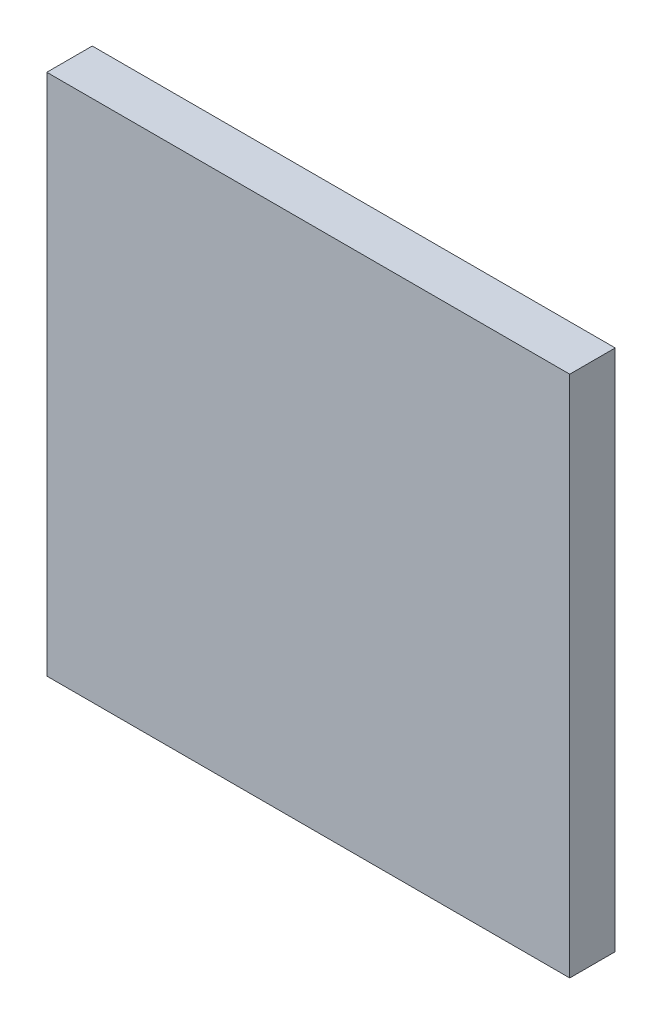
ISO-10303-21;
HEADER;
FILE_DESCRIPTION(('STEP AP214'),'2;1');
FILE_NAME('part.step','',(''),(''),'','','');
FILE_SCHEMA(('AUTOMOTIVE_DESIGN { 1 0 10303 214 1 1 1 1 }'));
ENDSEC;
DATA;
#1=APPLICATION_CONTEXT('core data for automotive mechanical design processes');
#2=APPLICATION_PROTOCOL_DEFINITION('international standard','automotive_design',2000,#1);
#3=PRODUCT_CONTEXT('',#1,'mechanical');
#4=PRODUCT('Part','Part','',(#3));
#5=PRODUCT_RELATED_PRODUCT_CATEGORY('part','',(#4));
#6=PRODUCT_DEFINITION_FORMATION('','',#4);
#7=PRODUCT_DEFINITION_CONTEXT('part definition',#1,'design');
#8=PRODUCT_DEFINITION('design','',#6,#7);
#9=PRODUCT_DEFINITION_SHAPE('','',#8);
#10=(LENGTH_UNIT() NAMED_UNIT(*) SI_UNIT(.MILLI.,.METRE.));
#11=(NAMED_UNIT(*) PLANE_ANGLE_UNIT() SI_UNIT($,.RADIAN.));
#12=(NAMED_UNIT(*) SI_UNIT($,.STERADIAN.) SOLID_ANGLE_UNIT());
#13=UNCERTAINTY_MEASURE_WITH_UNIT(LENGTH_MEASURE(1.E-05),#10,'distance_accuracy_value','');
#14=(GEOMETRIC_REPRESENTATION_CONTEXT(3) GLOBAL_UNCERTAINTY_ASSIGNED_CONTEXT((#13)) GLOBAL_UNIT_ASSIGNED_CONTEXT((#10,
#11,#12)) REPRESENTATION_CONTEXT('',''));
#15=CARTESIAN_POINT('',(0.,0.,0.));
#16=DIRECTION('',(0.,0.,1.));
#17=DIRECTION('',(1.,0.,0.));
#18=AXIS2_PLACEMENT_3D('',#15,#16,#17);
#19=CARTESIAN_POINT('',(0.,0.,12.));
#20=DIRECTION('',(0.,0.,1.));
#21=DIRECTION('',(1.,0.,0.));
#22=AXIS2_PLACEMENT_3D('',#19,#20,#21);
#23=PLANE('',#22);
#24=DIRECTION('',(1.,0.,0.));
#25=VECTOR('',#24,1.);
#26=CARTESIAN_POINT('',(-69.,-69.,12.));
#27=LINE('',#26,#25);
#28=CARTESIAN_POINT('',(-69.,-69.,12.));
#29=VERTEX_POINT('',#28);
#30=CARTESIAN_POINT('',(69.,-69.,12.));
#31=VERTEX_POINT('',#30);
#32=EDGE_CURVE('E81',#29,#31,#27,.T.);
#33=ORIENTED_EDGE('',*,*,#32,.T.);
#34=DIRECTION('',(0.,1.,0.));
#35=VECTOR('',#34,1.);
#36=CARTESIAN_POINT('',(69.,-69.,12.));
#37=LINE('',#36,#35);
#38=CARTESIAN_POINT('',(69.,69.,12.));
#39=VERTEX_POINT('',#38);
#40=EDGE_CURVE('E95',#31,#39,#37,.T.);
#41=ORIENTED_EDGE('',*,*,#40,.T.);
#42=DIRECTION('',(-1.,0.,0.));
#43=VECTOR('',#42,1.);
#44=CARTESIAN_POINT('',(69.,69.,12.));
#45=LINE('',#44,#43);
#46=CARTESIAN_POINT('',(-69.,69.,12.));
#47=VERTEX_POINT('',#46);
#48=EDGE_CURVE('E74',#39,#47,#45,.T.);
#49=ORIENTED_EDGE('',*,*,#48,.T.);
#50=DIRECTION('',(0.,-1.,0.));
#51=VECTOR('',#50,1.);
#52=CARTESIAN_POINT('',(-69.,69.,12.));
#53=LINE('',#52,#51);
#54=EDGE_CURVE('E10',#47,#29,#53,.T.);
#55=ORIENTED_EDGE('',*,*,#54,.T.);
#56=EDGE_LOOP('',(#33,#41,#49,#55));
#57=FACE_BOUND('',#56,.T.);
#58=ADVANCED_FACE('F16',(#57),#23,.T.);
#59=CARTESIAN_POINT('',(0.,0.,0.));
#60=DIRECTION('',(0.,0.,1.));
#61=DIRECTION('',(1.,0.,0.));
#62=AXIS2_PLACEMENT_3D('',#59,#60,#61);
#63=PLANE('',#62);
#64=DIRECTION('',(0.,-1.,0.));
#65=VECTOR('',#64,1.);
#66=CARTESIAN_POINT('',(-69.,69.,0.));
#67=LINE('',#66,#65);
#68=CARTESIAN_POINT('',(-69.,69.,0.));
#69=VERTEX_POINT('',#68);
#70=CARTESIAN_POINT('',(-69.,-69.,0.));
#71=VERTEX_POINT('',#70);
#72=EDGE_CURVE('E19',#69,#71,#67,.T.);
#73=ORIENTED_EDGE('',*,*,#72,.F.);
#74=DIRECTION('',(-1.,0.,0.));
#75=VECTOR('',#74,1.);
#76=CARTESIAN_POINT('',(69.,69.,0.));
#77=LINE('',#76,#75);
#78=CARTESIAN_POINT('',(69.,69.,0.));
#79=VERTEX_POINT('',#78);
#80=EDGE_CURVE('E99',#79,#69,#77,.T.);
#81=ORIENTED_EDGE('',*,*,#80,.F.);
#82=DIRECTION('',(0.,1.,0.));
#83=VECTOR('',#82,1.);
#84=CARTESIAN_POINT('',(69.,-69.,0.));
#85=LINE('',#84,#83);
#86=CARTESIAN_POINT('',(69.,-69.,0.));
#87=VERTEX_POINT('',#86);
#88=EDGE_CURVE('E83',#87,#79,#85,.T.);
#89=ORIENTED_EDGE('',*,*,#88,.F.);
#90=DIRECTION('',(1.,0.,0.));
#91=VECTOR('',#90,1.);
#92=CARTESIAN_POINT('',(-69.,-69.,0.));
#93=LINE('',#92,#91);
#94=EDGE_CURVE('E79',#71,#87,#93,.T.);
#95=ORIENTED_EDGE('',*,*,#94,.F.);
#96=EDGE_LOOP('',(#73,#81,#89,#95));
#97=FACE_BOUND('',#96,.T.);
#98=ADVANCED_FACE('F85',(#97),#63,.F.);
#99=CARTESIAN_POINT('',(-69.,69.,0.));
#100=DIRECTION('',(1.,0.,0.));
#101=DIRECTION('',(0.,1.,0.));
#102=AXIS2_PLACEMENT_3D('',#99,#100,#101);
#103=PLANE('',#102);
#104=ORIENTED_EDGE('',*,*,#72,.T.);
#105=DIRECTION('',(0.,0.,1.));
#106=VECTOR('',#105,1.);
#107=CARTESIAN_POINT('',(-69.,-69.,0.));
#108=LINE('',#107,#106);
#109=EDGE_CURVE('E68',#71,#29,#108,.T.);
#110=ORIENTED_EDGE('',*,*,#109,.T.);
#111=ORIENTED_EDGE('',*,*,#54,.F.);
#112=DIRECTION('',(0.,0.,1.));
#113=VECTOR('',#112,1.);
#114=CARTESIAN_POINT('',(-69.,69.,0.));
#115=LINE('',#114,#113);
#116=EDGE_CURVE('E71',#69,#47,#115,.T.);
#117=ORIENTED_EDGE('',*,*,#116,.F.);
#118=EDGE_LOOP('',(#104,#110,#111,#117));
#119=FACE_BOUND('',#118,.T.);
#120=ADVANCED_FACE('F67',(#119),#103,.F.);
#121=CARTESIAN_POINT('',(69.,69.,0.));
#122=DIRECTION('',(0.,-1.,0.));
#123=DIRECTION('',(0.,0.,-1.));
#124=AXIS2_PLACEMENT_3D('',#121,#122,#123);
#125=PLANE('',#124);
#126=ORIENTED_EDGE('',*,*,#80,.T.);
#127=ORIENTED_EDGE('',*,*,#116,.T.);
#128=ORIENTED_EDGE('',*,*,#48,.F.);
#129=DIRECTION('',(0.,0.,1.));
#130=VECTOR('',#129,1.);
#131=CARTESIAN_POINT('',(69.,69.,0.));
#132=LINE('',#131,#130);
#133=EDGE_CURVE('E100',#79,#39,#132,.T.);
#134=ORIENTED_EDGE('',*,*,#133,.F.);
#135=EDGE_LOOP('',(#126,#127,#128,#134));
#136=FACE_BOUND('',#135,.T.);
#137=ADVANCED_FACE('F116',(#136),#125,.F.);
#138=CARTESIAN_POINT('',(69.,-69.,0.));
#139=DIRECTION('',(-1.,0.,0.));
#140=DIRECTION('',(0.,0.,1.));
#141=AXIS2_PLACEMENT_3D('',#138,#139,#140);
#142=PLANE('',#141);
#143=ORIENTED_EDGE('',*,*,#88,.T.);
#144=ORIENTED_EDGE('',*,*,#133,.T.);
#145=ORIENTED_EDGE('',*,*,#40,.F.);
#146=DIRECTION('',(0.,0.,1.));
#147=VECTOR('',#146,1.);
#148=CARTESIAN_POINT('',(69.,-69.,0.));
#149=LINE('',#148,#147);
#150=EDGE_CURVE('E89',#87,#31,#149,.T.);
#151=ORIENTED_EDGE('',*,*,#150,.F.);
#152=EDGE_LOOP('',(#143,#144,#145,#151));
#153=FACE_BOUND('',#152,.T.);
#154=ADVANCED_FACE('F118',(#153),#142,.F.);
#155=CARTESIAN_POINT('',(-69.,-69.,0.));
#156=DIRECTION('',(0.,1.,0.));
#157=DIRECTION('',(1.,0.,0.));
#158=AXIS2_PLACEMENT_3D('',#155,#156,#157);
#159=PLANE('',#158);
#160=ORIENTED_EDGE('',*,*,#94,.T.);
#161=ORIENTED_EDGE('',*,*,#150,.T.);
#162=ORIENTED_EDGE('',*,*,#32,.F.);
#163=ORIENTED_EDGE('',*,*,#109,.F.);
#164=EDGE_LOOP('',(#160,#161,#162,#163));
#165=FACE_BOUND('',#164,.T.);
#166=ADVANCED_FACE('F77',(#165),#159,.F.);
#167=CLOSED_SHELL('',(#58,#98,#120,#137,#154,#166));
#168=MANIFOLD_SOLID_BREP('B1',#167);
#169=ADVANCED_BREP_SHAPE_REPRESENTATION('',(#18,#168),#14);
#170=SHAPE_DEFINITION_REPRESENTATION(#9,#169);
ENDSEC;
END-ISO-10303-21;
